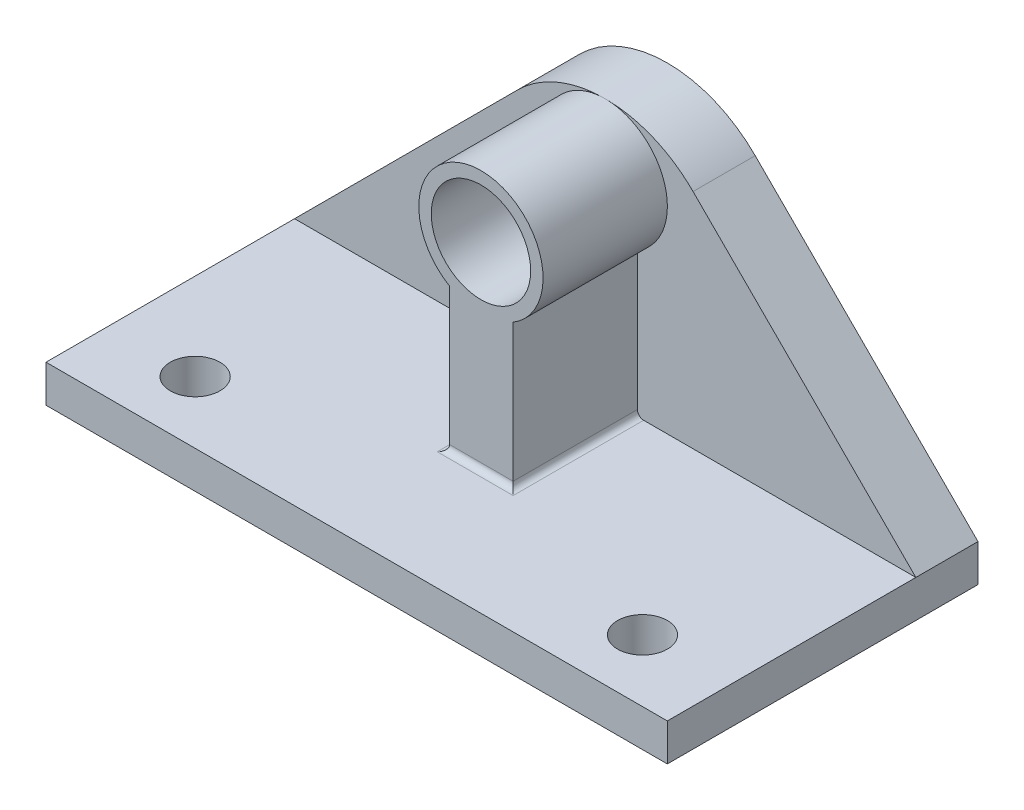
ISO-10303-21;
HEADER;
FILE_DESCRIPTION(('STEP AP214'),'2;1');
FILE_NAME('part.step','',(''),(''),'','','');
FILE_SCHEMA(('AUTOMOTIVE_DESIGN { 1 0 10303 214 1 1 1 1 }'));
ENDSEC;
DATA;
#1=APPLICATION_CONTEXT('core data for automotive mechanical design processes');
#2=APPLICATION_PROTOCOL_DEFINITION('international standard','automotive_design',2000,#1);
#3=PRODUCT_CONTEXT('',#1,'mechanical');
#4=PRODUCT('Part','Part','',(#3));
#5=PRODUCT_RELATED_PRODUCT_CATEGORY('part','',(#4));
#6=PRODUCT_DEFINITION_FORMATION('','',#4);
#7=PRODUCT_DEFINITION_CONTEXT('part definition',#1,'design');
#8=PRODUCT_DEFINITION('design','',#6,#7);
#9=PRODUCT_DEFINITION_SHAPE('','',#8);
#10=(LENGTH_UNIT() NAMED_UNIT(*) SI_UNIT(.MILLI.,.METRE.));
#11=(NAMED_UNIT(*) PLANE_ANGLE_UNIT() SI_UNIT($,.RADIAN.));
#12=(NAMED_UNIT(*) SI_UNIT($,.STERADIAN.) SOLID_ANGLE_UNIT());
#13=UNCERTAINTY_MEASURE_WITH_UNIT(LENGTH_MEASURE(1.E-05),#10,'distance_accuracy_value','');
#14=(GEOMETRIC_REPRESENTATION_CONTEXT(3) GLOBAL_UNCERTAINTY_ASSIGNED_CONTEXT((#13)) GLOBAL_UNIT_ASSIGNED_CONTEXT((#10,
#11,#12)) REPRESENTATION_CONTEXT('',''));
#15=CARTESIAN_POINT('',(0.,0.,0.));
#16=DIRECTION('',(0.,0.,1.));
#17=DIRECTION('',(1.,0.,0.));
#18=AXIS2_PLACEMENT_3D('',#15,#16,#17);
#19=CARTESIAN_POINT('',(250.,30.,100.));
#20=DIRECTION('',(0.,1.,0.));
#21=DIRECTION('',(0.,0.,1.));
#22=AXIS2_PLACEMENT_3D('',#19,#20,#21);
#23=PLANE('',#22);
#24=CARTESIAN_POINT('',(180.,30.,50.));
#25=DIRECTION('',(0.,1.,0.));
#26=DIRECTION('',(0.,0.,-1.));
#27=AXIS2_PLACEMENT_3D('',#24,#25,#26);
#28=CIRCLE('',#27,20.);
#29=CARTESIAN_POINT('',(180.,30.,30.));
#30=VERTEX_POINT('',#29);
#31=EDGE_CURVE('E249',#30,#30,#28,.T.);
#32=ORIENTED_EDGE('',*,*,#31,.F.);
#33=EDGE_LOOP('',(#32));
#34=FACE_BOUND('',#33,.T.);
#35=CARTESIAN_POINT('',(-180.,30.,50.));
#36=DIRECTION('',(0.,1.,0.));
#37=DIRECTION('',(0.,0.,1.));
#38=AXIS2_PLACEMENT_3D('',#35,#36,#37);
#39=CIRCLE('',#38,20.);
#40=CARTESIAN_POINT('',(-180.,30.,70.));
#41=VERTEX_POINT('',#40);
#42=EDGE_CURVE('E241',#41,#41,#39,.T.);
#43=ORIENTED_EDGE('',*,*,#42,.F.);
#44=EDGE_LOOP('',(#43));
#45=FACE_BOUND('',#44,.T.);
#46=DIRECTION('',(1.,0.,0.));
#47=VECTOR('',#46,1.);
#48=CARTESIAN_POINT('',(-25.1437223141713,30.,4.99999999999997));
#49=LINE('',#48,#47);
#50=CARTESIAN_POINT('',(30.9306544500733,30.,4.99999999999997));
#51=VERTEX_POINT('',#50);
#52=CARTESIAN_POINT('',(-30.1437223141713,30.,4.99999999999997));
#53=VERTEX_POINT('',#52);
#54=EDGE_CURVE('E228',#51,#53,#49,.F.);
#55=ORIENTED_EDGE('',*,*,#54,.T.);
#56=DIRECTION('',(0.,0.,-1.));
#57=VECTOR('',#56,1.);
#58=CARTESIAN_POINT('',(-30.1437223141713,30.,100.));
#59=LINE('',#58,#57);
#60=CARTESIAN_POINT('',(-30.1437223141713,30.,-100.));
#61=VERTEX_POINT('',#60);
#62=EDGE_CURVE('E230',#53,#61,#59,.T.);
#63=ORIENTED_EDGE('',*,*,#62,.T.);
#64=DIRECTION('',(-1.,0.,0.));
#65=VECTOR('',#64,1.);
#66=CARTESIAN_POINT('',(-250.,30.,-100.));
#67=LINE('',#66,#65);
#68=CARTESIAN_POINT('',(-250.,30.,-100.));
#69=VERTEX_POINT('',#68);
#70=EDGE_CURVE('E203',#61,#69,#67,.T.);
#71=ORIENTED_EDGE('',*,*,#70,.T.);
#72=DIRECTION('',(0.,0.,1.));
#73=VECTOR('',#72,1.);
#74=CARTESIAN_POINT('',(-250.,30.,-100.));
#75=LINE('',#74,#73);
#76=CARTESIAN_POINT('',(-250.,30.,100.));
#77=VERTEX_POINT('',#76);
#78=EDGE_CURVE('E208',#69,#77,#75,.T.);
#79=ORIENTED_EDGE('',*,*,#78,.T.);
#80=DIRECTION('',(1.,0.,0.));
#81=VECTOR('',#80,1.);
#82=CARTESIAN_POINT('',(-250.,30.,100.));
#83=LINE('',#82,#81);
#84=CARTESIAN_POINT('',(250.,30.,100.));
#85=VERTEX_POINT('',#84);
#86=EDGE_CURVE('E210',#77,#85,#83,.T.);
#87=ORIENTED_EDGE('',*,*,#86,.T.);
#88=DIRECTION('',(0.,0.,-1.));
#89=VECTOR('',#88,1.);
#90=CARTESIAN_POINT('',(250.,30.,-100.));
#91=LINE('',#90,#89);
#92=CARTESIAN_POINT('',(250.,30.,-100.));
#93=VERTEX_POINT('',#92);
#94=EDGE_CURVE('E200',#85,#93,#91,.T.);
#95=ORIENTED_EDGE('',*,*,#94,.T.);
#96=CARTESIAN_POINT('',(30.9306544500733,30.,-100.));
#97=VERTEX_POINT('',#96);
#98=EDGE_CURVE('E205',#93,#97,#67,.T.);
#99=ORIENTED_EDGE('',*,*,#98,.T.);
#100=DIRECTION('',(0.,0.,-1.));
#101=VECTOR('',#100,1.);
#102=CARTESIAN_POINT('',(30.9306544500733,30.,100.));
#103=LINE('',#102,#101);
#104=EDGE_CURVE('E226',#97,#51,#103,.F.);
#105=ORIENTED_EDGE('',*,*,#104,.T.);
#106=EDGE_LOOP('',(#55,#63,#71,#79,#87,#95,#99,#105));
#107=FACE_BOUND('',#106,.T.);
#108=ADVANCED_FACE('F30',(#34,#45,#107),#23,.T.);
#109=CARTESIAN_POINT('',(-7.14442209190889E-05,138.578715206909,-100.));
#110=DIRECTION('',(0.,0.,1.));
#111=DIRECTION('',(1.,0.,0.));
#112=AXIS2_PLACEMENT_3D('',#109,#110,#111);
#113=PLANE('',#112);
#114=ORIENTED_EDGE('',*,*,#70,.F.);
#115=CARTESIAN_POINT('',(-30.1437223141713,35.,-100.));
#116=DIRECTION('',(0.,0.,1.));
#117=DIRECTION('',(1.,0.,0.));
#118=AXIS2_PLACEMENT_3D('',#115,#116,#117);
#119=CIRCLE('',#118,5.);
#120=CARTESIAN_POINT('',(-25.1437223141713,35.,-100.));
#121=VERTEX_POINT('',#120);
#122=EDGE_CURVE('E55',#61,#121,#119,.T.);
#123=ORIENTED_EDGE('',*,*,#122,.T.);
#124=DIRECTION('',(0.,-1.,0.));
#125=VECTOR('',#124,1.);
#126=CARTESIAN_POINT('',(-25.1437223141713,30.,-100.));
#127=LINE('',#126,#125);
#128=CARTESIAN_POINT('',(-25.1437223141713,145.360716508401,-100.));
#129=VERTEX_POINT('',#128);
#130=EDGE_CURVE('E138',#129,#121,#127,.T.);
#131=ORIENTED_EDGE('',*,*,#130,.F.);
#132=CARTESIAN_POINT('',(0.,188.57868994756,-100.));
#133=DIRECTION('',(0.,0.,1.));
#134=DIRECTION('',(1.,0.,0.));
#135=AXIS2_PLACEMENT_3D('',#132,#133,#134);
#136=CIRCLE('',#135,50.);
#137=CARTESIAN_POINT('',(25.9306544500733,145.828237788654,-100.));
#138=VERTEX_POINT('',#137);
#139=EDGE_CURVE('E158',#138,#129,#136,.T.);
#140=ORIENTED_EDGE('',*,*,#139,.F.);
#141=DIRECTION('',(0.,1.,0.));
#142=VECTOR('',#141,1.);
#143=CARTESIAN_POINT('',(25.9306544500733,30.,-100.));
#144=LINE('',#143,#142);
#145=CARTESIAN_POINT('',(25.9306544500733,35.,-100.));
#146=VERTEX_POINT('',#145);
#147=EDGE_CURVE('E144',#146,#138,#144,.T.);
#148=ORIENTED_EDGE('',*,*,#147,.F.);
#149=CARTESIAN_POINT('',(30.9306544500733,35.,-100.));
#150=DIRECTION('',(0.,0.,1.));
#151=DIRECTION('',(1.,0.,0.));
#152=AXIS2_PLACEMENT_3D('',#149,#150,#151);
#153=CIRCLE('',#152,5.);
#154=EDGE_CURVE('E224',#146,#97,#153,.T.);
#155=ORIENTED_EDGE('',*,*,#154,.T.);
#156=ORIENTED_EDGE('',*,*,#98,.F.);
#157=DIRECTION('',(-0.707106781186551,0.707106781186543,0.));
#158=VECTOR('',#157,1.);
#159=CARTESIAN_POINT('',(250.,30.,-100.));
#160=LINE('',#159,#158);
#161=CARTESIAN_POINT('',(70.7106066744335,209.289393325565,-100.));
#162=VERTEX_POINT('',#161);
#163=EDGE_CURVE('E148',#93,#162,#160,.T.);
#164=ORIENTED_EDGE('',*,*,#163,.T.);
#165=CARTESIAN_POINT('',(-7.14442209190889E-05,138.578715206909,-100.));
#166=DIRECTION('',(0.,0.,1.));
#167=DIRECTION('',(1.,0.,0.));
#168=AXIS2_PLACEMENT_3D('',#165,#166,#167);
#169=CIRCLE('',#168,100.);
#170=CARTESIAN_POINT('',(-70.8111954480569,209.188804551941,-100.));
#171=VERTEX_POINT('',#170);
#172=EDGE_CURVE('E185',#162,#171,#169,.T.);
#173=ORIENTED_EDGE('',*,*,#172,.T.);
#174=DIRECTION('',(-0.707106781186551,-0.707106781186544,0.));
#175=VECTOR('',#174,1.);
#176=CARTESIAN_POINT('',(-70.8111954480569,209.188804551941,-100.));
#177=LINE('',#176,#175);
#178=EDGE_CURVE('E167',#171,#69,#177,.T.);
#179=ORIENTED_EDGE('',*,*,#178,.T.);
#180=EDGE_LOOP('',(#114,#123,#131,#140,#148,#155,#156,#164,#173,#179));
#181=FACE_BOUND('',#180,.T.);
#182=ADVANCED_FACE('F275',(#181),#113,.T.);
#183=CARTESIAN_POINT('',(250.,30.,-100.));
#184=DIRECTION('',(-1.,0.,0.));
#185=DIRECTION('',(0.,0.,1.));
#186=AXIS2_PLACEMENT_3D('',#183,#184,#185);
#187=PLANE('',#186);
#188=DIRECTION('',(0.,0.,-1.));
#189=VECTOR('',#188,1.);
#190=CARTESIAN_POINT('',(250.,0.,-100.));
#191=LINE('',#190,#189);
#192=CARTESIAN_POINT('',(250.,0.,100.));
#193=VERTEX_POINT('',#192);
#194=CARTESIAN_POINT('',(250.,0.,-150.));
#195=VERTEX_POINT('',#194);
#196=EDGE_CURVE('E193',#193,#195,#191,.T.);
#197=ORIENTED_EDGE('',*,*,#196,.T.);
#198=DIRECTION('',(0.,1.,0.));
#199=VECTOR('',#198,1.);
#200=CARTESIAN_POINT('',(250.,30.,-150.));
#201=LINE('',#200,#199);
#202=CARTESIAN_POINT('',(250.,30.,-150.));
#203=VERTEX_POINT('',#202);
#204=EDGE_CURVE('E179',#195,#203,#201,.T.);
#205=ORIENTED_EDGE('',*,*,#204,.T.);
#206=DIRECTION('',(0.,0.,1.));
#207=VECTOR('',#206,1.);
#208=CARTESIAN_POINT('',(250.,30.,-150.));
#209=LINE('',#208,#207);
#210=EDGE_CURVE('E190',#203,#93,#209,.T.);
#211=ORIENTED_EDGE('',*,*,#210,.T.);
#212=ORIENTED_EDGE('',*,*,#94,.F.);
#213=DIRECTION('',(0.,-1.,0.));
#214=VECTOR('',#213,1.);
#215=CARTESIAN_POINT('',(250.,30.,100.));
#216=LINE('',#215,#214);
#217=EDGE_CURVE('E212',#85,#193,#216,.T.);
#218=ORIENTED_EDGE('',*,*,#217,.T.);
#219=EDGE_LOOP('',(#197,#205,#211,#212,#218));
#220=FACE_BOUND('',#219,.T.);
#221=ADVANCED_FACE('F281',(#220),#187,.F.);
#222=CARTESIAN_POINT('',(-250.,30.,-100.));
#223=DIRECTION('',(1.,0.,0.));
#224=DIRECTION('',(0.,0.,-1.));
#225=AXIS2_PLACEMENT_3D('',#222,#223,#224);
#226=PLANE('',#225);
#227=DIRECTION('',(0.,0.,1.));
#228=VECTOR('',#227,1.);
#229=CARTESIAN_POINT('',(-250.,0.,-100.));
#230=LINE('',#229,#228);
#231=CARTESIAN_POINT('',(-250.,0.,-150.));
#232=VERTEX_POINT('',#231);
#233=CARTESIAN_POINT('',(-250.,0.,100.));
#234=VERTEX_POINT('',#233);
#235=EDGE_CURVE('E214',#232,#234,#230,.T.);
#236=ORIENTED_EDGE('',*,*,#235,.T.);
#237=DIRECTION('',(0.,-1.,0.));
#238=VECTOR('',#237,1.);
#239=CARTESIAN_POINT('',(-250.,30.,100.));
#240=LINE('',#239,#238);
#241=EDGE_CURVE('E219',#77,#234,#240,.T.);
#242=ORIENTED_EDGE('',*,*,#241,.F.);
#243=ORIENTED_EDGE('',*,*,#78,.F.);
#244=DIRECTION('',(0.,0.,1.));
#245=VECTOR('',#244,1.);
#246=CARTESIAN_POINT('',(-250.,30.,-150.));
#247=LINE('',#246,#245);
#248=CARTESIAN_POINT('',(-250.,30.,-150.));
#249=VERTEX_POINT('',#248);
#250=EDGE_CURVE('E194',#249,#69,#247,.T.);
#251=ORIENTED_EDGE('',*,*,#250,.F.);
#252=DIRECTION('',(0.,-1.,0.));
#253=VECTOR('',#252,1.);
#254=CARTESIAN_POINT('',(-250.,30.,-150.));
#255=LINE('',#254,#253);
#256=EDGE_CURVE('E173',#249,#232,#255,.T.);
#257=ORIENTED_EDGE('',*,*,#256,.T.);
#258=EDGE_LOOP('',(#236,#242,#243,#251,#257));
#259=FACE_BOUND('',#258,.T.);
#260=ADVANCED_FACE('F296',(#259),#226,.F.);
#261=CARTESIAN_POINT('',(-250.,30.,100.));
#262=DIRECTION('',(0.,0.,-1.));
#263=DIRECTION('',(-1.,0.,0.));
#264=AXIS2_PLACEMENT_3D('',#261,#262,#263);
#265=PLANE('',#264);
#266=DIRECTION('',(1.,0.,0.));
#267=VECTOR('',#266,1.);
#268=CARTESIAN_POINT('',(-250.,0.,100.));
#269=LINE('',#268,#267);
#270=EDGE_CURVE('E204',#234,#193,#269,.T.);
#271=ORIENTED_EDGE('',*,*,#270,.T.);
#272=ORIENTED_EDGE('',*,*,#217,.F.);
#273=ORIENTED_EDGE('',*,*,#86,.F.);
#274=ORIENTED_EDGE('',*,*,#241,.T.);
#275=EDGE_LOOP('',(#271,#272,#273,#274));
#276=FACE_BOUND('',#275,.T.);
#277=ADVANCED_FACE('F292',(#276),#265,.F.);
#278=CARTESIAN_POINT('',(250.,0.,100.));
#279=DIRECTION('',(0.,1.,0.));
#280=DIRECTION('',(0.,0.,1.));
#281=AXIS2_PLACEMENT_3D('',#278,#279,#280);
#282=PLANE('',#281);
#283=CARTESIAN_POINT('',(180.,0.,50.));
#284=DIRECTION('',(0.,1.,0.));
#285=DIRECTION('',(0.,0.,1.));
#286=AXIS2_PLACEMENT_3D('',#283,#284,#285);
#287=CIRCLE('',#286,20.);
#288=CARTESIAN_POINT('',(180.,0.,70.));
#289=VERTEX_POINT('',#288);
#290=EDGE_CURVE('E34',#289,#289,#287,.T.);
#291=ORIENTED_EDGE('',*,*,#290,.T.);
#292=EDGE_LOOP('',(#291));
#293=FACE_BOUND('',#292,.T.);
#294=CARTESIAN_POINT('',(-180.,0.,50.));
#295=DIRECTION('',(0.,1.,0.));
#296=DIRECTION('',(0.,0.,1.));
#297=AXIS2_PLACEMENT_3D('',#294,#295,#296);
#298=CIRCLE('',#297,20.);
#299=CARTESIAN_POINT('',(-180.,0.,70.));
#300=VERTEX_POINT('',#299);
#301=EDGE_CURVE('E239',#300,#300,#298,.T.);
#302=ORIENTED_EDGE('',*,*,#301,.T.);
#303=EDGE_LOOP('',(#302));
#304=FACE_BOUND('',#303,.T.);
#305=ORIENTED_EDGE('',*,*,#196,.F.);
#306=ORIENTED_EDGE('',*,*,#270,.F.);
#307=ORIENTED_EDGE('',*,*,#235,.F.);
#308=DIRECTION('',(1.,0.,0.));
#309=VECTOR('',#308,1.);
#310=CARTESIAN_POINT('',(-250.,0.,-150.));
#311=LINE('',#310,#309);
#312=EDGE_CURVE('E176',#232,#195,#311,.T.);
#313=ORIENTED_EDGE('',*,*,#312,.T.);
#314=EDGE_LOOP('',(#305,#306,#307,#313));
#315=FACE_BOUND('',#314,.T.);
#316=ADVANCED_FACE('F289',(#293,#304,#315),#282,.F.);
#317=CARTESIAN_POINT('',(250.,30.,-150.));
#318=DIRECTION('',(0.707106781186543,0.707106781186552,0.));
#319=DIRECTION('',(-0.707106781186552,0.707106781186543,0.));
#320=AXIS2_PLACEMENT_3D('',#317,#318,#319);
#321=PLANE('',#320);
#322=ORIENTED_EDGE('',*,*,#163,.F.);
#323=ORIENTED_EDGE('',*,*,#210,.F.);
#324=DIRECTION('',(-0.707106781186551,0.707106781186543,0.));
#325=VECTOR('',#324,1.);
#326=CARTESIAN_POINT('',(250.,30.,-150.));
#327=LINE('',#326,#325);
#328=CARTESIAN_POINT('',(70.7106066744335,209.289393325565,-150.));
#329=VERTEX_POINT('',#328);
#330=EDGE_CURVE('E163',#203,#329,#327,.T.);
#331=ORIENTED_EDGE('',*,*,#330,.T.);
#332=DIRECTION('',(0.,0.,1.));
#333=VECTOR('',#332,1.);
#334=CARTESIAN_POINT('',(70.7106066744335,209.289393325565,-150.));
#335=LINE('',#334,#333);
#336=EDGE_CURVE('E182',#329,#162,#335,.T.);
#337=ORIENTED_EDGE('',*,*,#336,.T.);
#338=EDGE_LOOP('',(#322,#323,#331,#337));
#339=FACE_BOUND('',#338,.T.);
#340=ADVANCED_FACE('F287',(#339),#321,.T.);
#341=CARTESIAN_POINT('',(-70.8111954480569,209.188804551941,-150.));
#342=DIRECTION('',(-0.707106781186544,0.707106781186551,0.));
#343=DIRECTION('',(-0.707106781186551,-0.707106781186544,0.));
#344=AXIS2_PLACEMENT_3D('',#341,#342,#343);
#345=PLANE('',#344);
#346=ORIENTED_EDGE('',*,*,#178,.F.);
#347=DIRECTION('',(0.,0.,1.));
#348=VECTOR('',#347,1.);
#349=CARTESIAN_POINT('',(-70.8111954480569,209.188804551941,-150.));
#350=LINE('',#349,#348);
#351=CARTESIAN_POINT('',(-70.8111954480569,209.188804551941,-150.));
#352=VERTEX_POINT('',#351);
#353=EDGE_CURVE('E197',#352,#171,#350,.T.);
#354=ORIENTED_EDGE('',*,*,#353,.F.);
#355=DIRECTION('',(-0.707106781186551,-0.707106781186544,0.));
#356=VECTOR('',#355,1.);
#357=CARTESIAN_POINT('',(-70.8111954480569,209.188804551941,-150.));
#358=LINE('',#357,#356);
#359=EDGE_CURVE('E170',#352,#249,#358,.T.);
#360=ORIENTED_EDGE('',*,*,#359,.T.);
#361=ORIENTED_EDGE('',*,*,#250,.T.);
#362=EDGE_LOOP('',(#346,#354,#360,#361));
#363=FACE_BOUND('',#362,.T.);
#364=ADVANCED_FACE('F330',(#363),#345,.T.);
#365=CARTESIAN_POINT('',(-7.14442209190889E-05,138.578715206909,-150.));
#366=DIRECTION('',(0.,0.,1.));
#367=DIRECTION('',(1.,0.,0.));
#368=AXIS2_PLACEMENT_3D('',#365,#366,#367);
#369=CYLINDRICAL_SURFACE('',#368,100.);
#370=ORIENTED_EDGE('',*,*,#172,.F.);
#371=ORIENTED_EDGE('',*,*,#336,.F.);
#372=CARTESIAN_POINT('',(-7.14442209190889E-05,138.578715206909,-150.));
#373=DIRECTION('',(0.,0.,1.));
#374=DIRECTION('',(1.,0.,0.));
#375=AXIS2_PLACEMENT_3D('',#372,#373,#374);
#376=CIRCLE('',#375,100.);
#377=EDGE_CURVE('E166',#329,#352,#376,.T.);
#378=ORIENTED_EDGE('',*,*,#377,.T.);
#379=ORIENTED_EDGE('',*,*,#353,.T.);
#380=EDGE_LOOP('',(#370,#371,#378,#379));
#381=FACE_BOUND('',#380,.T.);
#382=ADVANCED_FACE('F328',(#381),#369,.T.);
#383=CARTESIAN_POINT('',(-7.14442209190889E-05,138.578715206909,-150.));
#384=DIRECTION('',(0.,0.,1.));
#385=DIRECTION('',(1.,0.,0.));
#386=AXIS2_PLACEMENT_3D('',#383,#384,#385);
#387=PLANE('',#386);
#388=CARTESIAN_POINT('',(0.,188.57868994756,-150.));
#389=DIRECTION('',(0.,0.,1.));
#390=DIRECTION('',(1.,0.,0.));
#391=AXIS2_PLACEMENT_3D('',#388,#389,#390);
#392=CIRCLE('',#391,40.);
#393=CARTESIAN_POINT('',(40.,188.57868994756,-150.));
#394=VERTEX_POINT('',#393);
#395=EDGE_CURVE('E159',#394,#394,#392,.T.);
#396=ORIENTED_EDGE('',*,*,#395,.T.);
#397=EDGE_LOOP('',(#396));
#398=FACE_BOUND('',#397,.T.);
#399=ORIENTED_EDGE('',*,*,#330,.F.);
#400=ORIENTED_EDGE('',*,*,#204,.F.);
#401=ORIENTED_EDGE('',*,*,#312,.F.);
#402=ORIENTED_EDGE('',*,*,#256,.F.);
#403=ORIENTED_EDGE('',*,*,#359,.F.);
#404=ORIENTED_EDGE('',*,*,#377,.F.);
#405=EDGE_LOOP('',(#399,#400,#401,#402,#403,#404));
#406=FACE_BOUND('',#405,.T.);
#407=ADVANCED_FACE('F256',(#398,#406),#387,.F.);
#408=CARTESIAN_POINT('',(25.9306544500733,30.,0.));
#409=DIRECTION('',(-1.,0.,0.));
#410=DIRECTION('',(0.,0.,1.));
#411=AXIS2_PLACEMENT_3D('',#408,#409,#410);
#412=PLANE('',#411);
#413=DIRECTION('',(0.,1.,0.));
#414=VECTOR('',#413,1.);
#415=CARTESIAN_POINT('',(25.9306544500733,30.,0.));
#416=LINE('',#415,#414);
#417=CARTESIAN_POINT('',(25.9306544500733,35.,0.));
#418=VERTEX_POINT('',#417);
#419=CARTESIAN_POINT('',(25.9306544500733,145.828237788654,0.));
#420=VERTEX_POINT('',#419);
#421=EDGE_CURVE('E128',#418,#420,#416,.T.);
#422=ORIENTED_EDGE('',*,*,#421,.F.);
#423=DIRECTION('',(0.,0.,-1.));
#424=VECTOR('',#423,1.);
#425=CARTESIAN_POINT('',(25.9306544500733,35.,0.));
#426=LINE('',#425,#424);
#427=EDGE_CURVE('E222',#418,#146,#426,.T.);
#428=ORIENTED_EDGE('',*,*,#427,.T.);
#429=ORIENTED_EDGE('',*,*,#147,.T.);
#430=DIRECTION('',(0.,0.,-1.));
#431=VECTOR('',#430,1.);
#432=CARTESIAN_POINT('',(25.9306544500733,145.828237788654,0.));
#433=LINE('',#432,#431);
#434=EDGE_CURVE('E141',#420,#138,#433,.T.);
#435=ORIENTED_EDGE('',*,*,#434,.F.);
#436=EDGE_LOOP('',(#422,#428,#429,#435));
#437=FACE_BOUND('',#436,.T.);
#438=ADVANCED_FACE('F142',(#437),#412,.F.);
#439=CARTESIAN_POINT('',(0.,188.57868994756,0.));
#440=DIRECTION('',(0.,0.,-1.));
#441=DIRECTION('',(-1.,0.,0.));
#442=AXIS2_PLACEMENT_3D('',#439,#440,#441);
#443=CYLINDRICAL_SURFACE('',#442,50.);
#444=ORIENTED_EDGE('',*,*,#139,.T.);
#445=DIRECTION('',(0.,0.,-1.));
#446=VECTOR('',#445,1.);
#447=CARTESIAN_POINT('',(-25.1437223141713,145.360716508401,0.));
#448=LINE('',#447,#446);
#449=CARTESIAN_POINT('',(-25.1437223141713,145.360716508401,0.));
#450=VERTEX_POINT('',#449);
#451=EDGE_CURVE('E149',#450,#129,#448,.T.);
#452=ORIENTED_EDGE('',*,*,#451,.F.);
#453=CARTESIAN_POINT('',(0.,188.57868994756,0.));
#454=DIRECTION('',(0.,0.,1.));
#455=DIRECTION('',(1.,0.,0.));
#456=AXIS2_PLACEMENT_3D('',#453,#454,#455);
#457=CIRCLE('',#456,50.);
#458=EDGE_CURVE('E132',#420,#450,#457,.T.);
#459=ORIENTED_EDGE('',*,*,#458,.F.);
#460=ORIENTED_EDGE('',*,*,#434,.T.);
#461=EDGE_LOOP('',(#444,#452,#459,#460));
#462=FACE_BOUND('',#461,.T.);
#463=ADVANCED_FACE('F151',(#462),#443,.T.);
#464=CARTESIAN_POINT('',(-25.1437223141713,30.,0.));
#465=DIRECTION('',(1.,0.,0.));
#466=DIRECTION('',(0.,0.,-1.));
#467=AXIS2_PLACEMENT_3D('',#464,#465,#466);
#468=PLANE('',#467);
#469=ORIENTED_EDGE('',*,*,#130,.T.);
#470=DIRECTION('',(0.,0.,-1.));
#471=VECTOR('',#470,1.);
#472=CARTESIAN_POINT('',(-25.1437223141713,35.,0.));
#473=LINE('',#472,#471);
#474=CARTESIAN_POINT('',(-25.1437223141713,35.,0.));
#475=VERTEX_POINT('',#474);
#476=EDGE_CURVE('E47',#121,#475,#473,.F.);
#477=ORIENTED_EDGE('',*,*,#476,.T.);
#478=DIRECTION('',(0.,-1.,0.));
#479=VECTOR('',#478,1.);
#480=CARTESIAN_POINT('',(-25.1437223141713,30.,0.));
#481=LINE('',#480,#479);
#482=EDGE_CURVE('E152',#450,#475,#481,.T.);
#483=ORIENTED_EDGE('',*,*,#482,.F.);
#484=ORIENTED_EDGE('',*,*,#451,.T.);
#485=EDGE_LOOP('',(#469,#477,#483,#484));
#486=FACE_BOUND('',#485,.T.);
#487=ADVANCED_FACE('F270',(#486),#468,.F.);
#488=CARTESIAN_POINT('',(0.,188.57868994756,0.));
#489=DIRECTION('',(0.,0.,1.));
#490=DIRECTION('',(1.,0.,0.));
#491=AXIS2_PLACEMENT_3D('',#488,#489,#490);
#492=PLANE('',#491);
#493=CARTESIAN_POINT('',(0.,188.57868994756,0.));
#494=DIRECTION('',(0.,0.,1.));
#495=DIRECTION('',(1.,0.,0.));
#496=AXIS2_PLACEMENT_3D('',#493,#494,#495);
#497=CIRCLE('',#496,40.);
#498=CARTESIAN_POINT('',(40.,188.57868994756,0.));
#499=VERTEX_POINT('',#498);
#500=EDGE_CURVE('E238',#499,#499,#497,.T.);
#501=ORIENTED_EDGE('',*,*,#500,.F.);
#502=EDGE_LOOP('',(#501));
#503=FACE_BOUND('',#502,.T.);
#504=ORIENTED_EDGE('',*,*,#482,.T.);
#505=DIRECTION('',(1.,0.,0.));
#506=VECTOR('',#505,1.);
#507=CARTESIAN_POINT('',(30.9306544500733,35.,0.));
#508=LINE('',#507,#506);
#509=EDGE_CURVE('E39',#475,#418,#508,.T.);
#510=ORIENTED_EDGE('',*,*,#509,.T.);
#511=ORIENTED_EDGE('',*,*,#421,.T.);
#512=ORIENTED_EDGE('',*,*,#458,.T.);
#513=EDGE_LOOP('',(#504,#510,#511,#512));
#514=FACE_BOUND('',#513,.T.);
#515=ADVANCED_FACE('F130',(#503,#514),#492,.T.);
#516=CARTESIAN_POINT('',(0.,188.57868994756,-210.));
#517=DIRECTION('',(0.,0.,1.));
#518=DIRECTION('',(1.,0.,0.));
#519=AXIS2_PLACEMENT_3D('',#516,#517,#518);
#520=CYLINDRICAL_SURFACE('',#519,40.);
#521=ORIENTED_EDGE('',*,*,#500,.T.);
#522=EDGE_LOOP('',(#521));
#523=FACE_BOUND('',#522,.T.);
#524=ORIENTED_EDGE('',*,*,#395,.F.);
#525=EDGE_LOOP('',(#524));
#526=FACE_BOUND('',#525,.T.);
#527=ADVANCED_FACE('F259',(#523,#526),#520,.F.);
#528=CARTESIAN_POINT('',(30.9306544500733,35.,0.));
#529=DIRECTION('',(0.,0.,-1.));
#530=DIRECTION('',(-1.,0.,0.));
#531=AXIS2_PLACEMENT_3D('',#528,#529,#530);
#532=CYLINDRICAL_SURFACE('',#531,5.);
#533=ORIENTED_EDGE('',*,*,#427,.F.);
#534=CARTESIAN_POINT('',(30.9306544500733,35.,4.99999999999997));
#535=DIRECTION('',(0.707106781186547,0.,-0.707106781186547));
#536=DIRECTION('',(-0.707106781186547,0.,-0.707106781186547));
#537=AXIS2_PLACEMENT_3D('',#534,#535,#536);
#538=ELLIPSE('',#537,7.07106781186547,5.);
#539=EDGE_CURVE('E11',#418,#51,#538,.F.);
#540=ORIENTED_EDGE('',*,*,#539,.T.);
#541=ORIENTED_EDGE('',*,*,#104,.F.);
#542=ORIENTED_EDGE('',*,*,#154,.F.);
#543=EDGE_LOOP('',(#533,#540,#541,#542));
#544=FACE_BOUND('',#543,.T.);
#545=ADVANCED_FACE('F261',(#544),#532,.F.);
#546=CARTESIAN_POINT('',(0.,35.,4.99999999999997));
#547=DIRECTION('',(-1.,0.,0.));
#548=DIRECTION('',(0.,0.,1.));
#549=AXIS2_PLACEMENT_3D('',#546,#547,#548);
#550=CYLINDRICAL_SURFACE('',#549,5.);
#551=ORIENTED_EDGE('',*,*,#539,.F.);
#552=ORIENTED_EDGE('',*,*,#509,.F.);
#553=CARTESIAN_POINT('',(-30.1437223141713,35.,4.99999999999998));
#554=DIRECTION('',(-0.707106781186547,0.,-0.707106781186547));
#555=DIRECTION('',(-0.707106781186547,0.,0.707106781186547));
#556=AXIS2_PLACEMENT_3D('',#553,#554,#555);
#557=ELLIPSE('',#556,7.07106781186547,5.);
#558=EDGE_CURVE('E236',#53,#475,#557,.F.);
#559=ORIENTED_EDGE('',*,*,#558,.F.);
#560=ORIENTED_EDGE('',*,*,#54,.F.);
#561=EDGE_LOOP('',(#551,#552,#559,#560));
#562=FACE_BOUND('',#561,.T.);
#563=ADVANCED_FACE('F32',(#562),#550,.F.);
#564=CARTESIAN_POINT('',(-30.1437223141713,35.,100.));
#565=DIRECTION('',(0.,0.,-1.));
#566=DIRECTION('',(-1.,0.,0.));
#567=AXIS2_PLACEMENT_3D('',#564,#565,#566);
#568=CYLINDRICAL_SURFACE('',#567,5.);
#569=ORIENTED_EDGE('',*,*,#558,.T.);
#570=ORIENTED_EDGE('',*,*,#476,.F.);
#571=ORIENTED_EDGE('',*,*,#122,.F.);
#572=ORIENTED_EDGE('',*,*,#62,.F.);
#573=EDGE_LOOP('',(#569,#570,#571,#572));
#574=FACE_BOUND('',#573,.T.);
#575=ADVANCED_FACE('F303',(#574),#568,.F.);
#576=CARTESIAN_POINT('',(-180.,-180.,50.));
#577=DIRECTION('',(0.,1.,0.));
#578=DIRECTION('',(0.,0.,1.));
#579=AXIS2_PLACEMENT_3D('',#576,#577,#578);
#580=CYLINDRICAL_SURFACE('',#579,20.);
#581=ORIENTED_EDGE('',*,*,#42,.T.);
#582=EDGE_LOOP('',(#581));
#583=FACE_BOUND('',#582,.T.);
#584=ORIENTED_EDGE('',*,*,#301,.F.);
#585=EDGE_LOOP('',(#584));
#586=FACE_BOUND('',#585,.T.);
#587=ADVANCED_FACE('F305',(#583,#586),#580,.F.);
#588=CARTESIAN_POINT('',(180.,-180.,50.));
#589=DIRECTION('',(0.,1.,0.));
#590=DIRECTION('',(0.,0.,1.));
#591=AXIS2_PLACEMENT_3D('',#588,#589,#590);
#592=CYLINDRICAL_SURFACE('',#591,20.);
#593=ORIENTED_EDGE('',*,*,#31,.T.);
#594=EDGE_LOOP('',(#593));
#595=FACE_BOUND('',#594,.T.);
#596=ORIENTED_EDGE('',*,*,#290,.F.);
#597=EDGE_LOOP('',(#596));
#598=FACE_BOUND('',#597,.T.);
#599=ADVANCED_FACE('F311',(#595,#598),#592,.F.);
#600=CLOSED_SHELL('',(#108,#182,#221,#260,#277,#316,#340,#364,#382,#407,#438,#463,#487,#515,
#527,#545,#563,#575,#587,#599));
#601=MANIFOLD_SOLID_BREP('B2',#600);
#602=ADVANCED_BREP_SHAPE_REPRESENTATION('',(#18,#601),#14);
#603=SHAPE_DEFINITION_REPRESENTATION(#9,#602);
ENDSEC;
END-ISO-10303-21;
